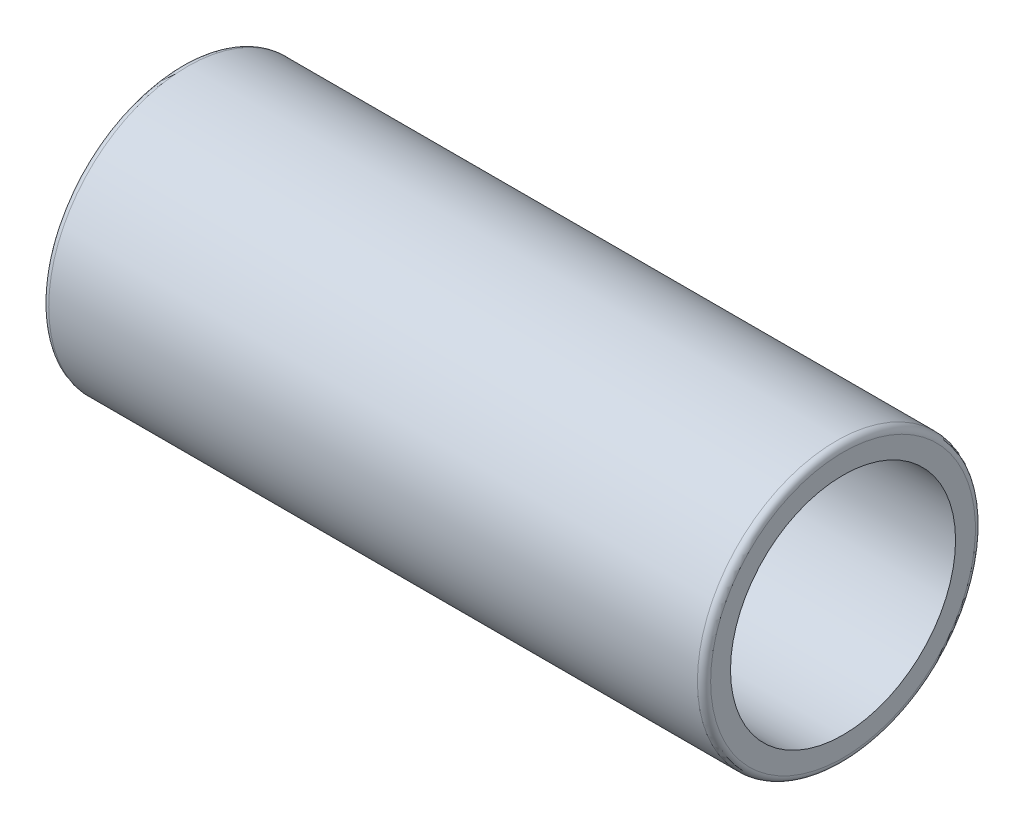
ISO-10303-21;
HEADER;
FILE_DESCRIPTION(('STEP AP214'),'2;1');
FILE_NAME('part.step','',(''),(''),'','','');
FILE_SCHEMA(('AUTOMOTIVE_DESIGN { 1 0 10303 214 1 1 1 1 }'));
ENDSEC;
DATA;
#1=APPLICATION_CONTEXT('core data for automotive mechanical design processes');
#2=APPLICATION_PROTOCOL_DEFINITION('international standard','automotive_design',2000,#1);
#3=PRODUCT_CONTEXT('',#1,'mechanical');
#4=PRODUCT('Part','Part','',(#3));
#5=PRODUCT_RELATED_PRODUCT_CATEGORY('part','',(#4));
#6=PRODUCT_DEFINITION_FORMATION('','',#4);
#7=PRODUCT_DEFINITION_CONTEXT('part definition',#1,'design');
#8=PRODUCT_DEFINITION('design','',#6,#7);
#9=PRODUCT_DEFINITION_SHAPE('','',#8);
#10=(LENGTH_UNIT() NAMED_UNIT(*) SI_UNIT(.MILLI.,.METRE.));
#11=(NAMED_UNIT(*) PLANE_ANGLE_UNIT() SI_UNIT($,.RADIAN.));
#12=(NAMED_UNIT(*) SI_UNIT($,.STERADIAN.) SOLID_ANGLE_UNIT());
#13=UNCERTAINTY_MEASURE_WITH_UNIT(LENGTH_MEASURE(1.E-05),#10,'distance_accuracy_value','');
#14=(GEOMETRIC_REPRESENTATION_CONTEXT(3) GLOBAL_UNCERTAINTY_ASSIGNED_CONTEXT((#13)) GLOBAL_UNIT_ASSIGNED_CONTEXT((#10,
#11,#12)) REPRESENTATION_CONTEXT('',''));
#15=CARTESIAN_POINT('',(0.,0.,0.));
#16=DIRECTION('',(0.,0.,1.));
#17=DIRECTION('',(1.,0.,0.));
#18=AXIS2_PLACEMENT_3D('',#15,#16,#17);
#19=CARTESIAN_POINT('',(0.,0.,0.));
#20=DIRECTION('',(-1.,0.,0.));
#21=DIRECTION('',(0.,0.,1.));
#22=AXIS2_PLACEMENT_3D('',#19,#20,#21);
#23=CYLINDRICAL_SURFACE('',#22,6.);
#24=CARTESIAN_POINT('',(1.9999999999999,0.,0.));
#25=DIRECTION('',(-1.,0.,0.));
#26=DIRECTION('',(0.,0.,1.));
#27=AXIS2_PLACEMENT_3D('',#24,#25,#26);
#28=CIRCLE('',#27,6.);
#29=CARTESIAN_POINT('',(1.9999999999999,0.,6.));
#30=VERTEX_POINT('',#29);
#31=EDGE_CURVE('E43',#30,#30,#28,.T.);
#32=ORIENTED_EDGE('',*,*,#31,.F.);
#33=EDGE_LOOP('',(#32));
#34=FACE_BOUND('',#33,.T.);
#35=CARTESIAN_POINT('',(0.,0.,0.));
#36=DIRECTION('',(-1.,0.,0.));
#37=DIRECTION('',(0.,0.,1.));
#38=AXIS2_PLACEMENT_3D('',#35,#36,#37);
#39=CIRCLE('',#38,6.);
#40=CARTESIAN_POINT('',(0.,0.,6.));
#41=VERTEX_POINT('',#40);
#42=EDGE_CURVE('E34',#41,#41,#39,.T.);
#43=ORIENTED_EDGE('',*,*,#42,.T.);
#44=EDGE_LOOP('',(#43));
#45=FACE_BOUND('',#44,.T.);
#46=ADVANCED_FACE('F14',(#34,#45),#23,.F.);
#47=CARTESIAN_POINT('',(0.,6.,0.));
#48=DIRECTION('',(1.,0.,0.));
#49=DIRECTION('',(0.,0.,-1.));
#50=AXIS2_PLACEMENT_3D('',#47,#48,#49);
#51=PLANE('',#50);
#52=CARTESIAN_POINT('',(0.,0.,0.));
#53=DIRECTION('',(1.,0.,0.));
#54=DIRECTION('',(0.,0.,-1.));
#55=AXIS2_PLACEMENT_3D('',#52,#53,#54);
#56=CIRCLE('',#55,20.);
#57=CARTESIAN_POINT('',(0.,0.,-20.));
#58=VERTEX_POINT('',#57);
#59=EDGE_CURVE('E21',#58,#58,#56,.F.);
#60=ORIENTED_EDGE('',*,*,#59,.T.);
#61=EDGE_LOOP('',(#60));
#62=FACE_BOUND('',#61,.T.);
#63=ORIENTED_EDGE('',*,*,#42,.F.);
#64=EDGE_LOOP('',(#63));
#65=FACE_BOUND('',#64,.T.);
#66=ADVANCED_FACE('F51',(#62,#65),#51,.F.);
#67=CARTESIAN_POINT('',(0.,0.,0.));
#68=DIRECTION('',(-1.,0.,0.));
#69=DIRECTION('',(0.,0.,1.));
#70=AXIS2_PLACEMENT_3D('',#67,#68,#69);
#71=CYLINDRICAL_SURFACE('',#70,21.);
#72=CARTESIAN_POINT('',(1.,0.,0.));
#73=DIRECTION('',(1.,0.,0.));
#74=DIRECTION('',(0.,0.,-1.));
#75=AXIS2_PLACEMENT_3D('',#72,#73,#74);
#76=CIRCLE('',#75,21.);
#77=CARTESIAN_POINT('',(1.,0.,-21.));
#78=VERTEX_POINT('',#77);
#79=EDGE_CURVE('E9',#78,#78,#76,.T.);
#80=ORIENTED_EDGE('',*,*,#79,.T.);
#81=EDGE_LOOP('',(#80));
#82=FACE_BOUND('',#81,.T.);
#83=CARTESIAN_POINT('',(99.,0.,0.));
#84=DIRECTION('',(-1.,0.,0.));
#85=DIRECTION('',(0.,0.,1.));
#86=AXIS2_PLACEMENT_3D('',#83,#84,#85);
#87=CIRCLE('',#86,21.);
#88=CARTESIAN_POINT('',(99.,0.,21.));
#89=VERTEX_POINT('',#88);
#90=EDGE_CURVE('E29',#89,#89,#87,.T.);
#91=ORIENTED_EDGE('',*,*,#90,.T.);
#92=EDGE_LOOP('',(#91));
#93=FACE_BOUND('',#92,.T.);
#94=ADVANCED_FACE('F56',(#82,#93),#71,.T.);
#95=CARTESIAN_POINT('',(100.,21.,0.));
#96=DIRECTION('',(-1.,0.,0.));
#97=DIRECTION('',(0.,0.,1.));
#98=AXIS2_PLACEMENT_3D('',#95,#96,#97);
#99=PLANE('',#98);
#100=CARTESIAN_POINT('',(100.,0.,0.));
#101=DIRECTION('',(-1.,0.,0.));
#102=DIRECTION('',(0.,0.,1.));
#103=AXIS2_PLACEMENT_3D('',#100,#101,#102);
#104=CIRCLE('',#103,20.);
#105=CARTESIAN_POINT('',(100.,0.,20.));
#106=VERTEX_POINT('',#105);
#107=EDGE_CURVE('E25',#106,#106,#104,.F.);
#108=ORIENTED_EDGE('',*,*,#107,.T.);
#109=EDGE_LOOP('',(#108));
#110=FACE_BOUND('',#109,.T.);
#111=CARTESIAN_POINT('',(100.,0.,0.));
#112=DIRECTION('',(-1.,0.,0.));
#113=DIRECTION('',(0.,0.,1.));
#114=AXIS2_PLACEMENT_3D('',#111,#112,#113);
#115=CIRCLE('',#114,17.);
#116=CARTESIAN_POINT('',(100.,0.,17.));
#117=VERTEX_POINT('',#116);
#118=EDGE_CURVE('E37',#117,#117,#115,.T.);
#119=ORIENTED_EDGE('',*,*,#118,.T.);
#120=EDGE_LOOP('',(#119));
#121=FACE_BOUND('',#120,.T.);
#122=ADVANCED_FACE('F63',(#110,#121),#99,.F.);
#123=CARTESIAN_POINT('',(0.,0.,0.));
#124=DIRECTION('',(-1.,0.,0.));
#125=DIRECTION('',(0.,0.,1.));
#126=AXIS2_PLACEMENT_3D('',#123,#124,#125);
#127=CYLINDRICAL_SURFACE('',#126,17.);
#128=ORIENTED_EDGE('',*,*,#118,.F.);
#129=EDGE_LOOP('',(#128));
#130=FACE_BOUND('',#129,.T.);
#131=CARTESIAN_POINT('',(13.,0.,0.));
#132=DIRECTION('',(-1.,0.,0.));
#133=DIRECTION('',(0.,0.,1.));
#134=AXIS2_PLACEMENT_3D('',#131,#132,#133);
#135=CIRCLE('',#134,17.);
#136=CARTESIAN_POINT('',(13.,0.,17.));
#137=VERTEX_POINT('',#136);
#138=EDGE_CURVE('E40',#137,#137,#135,.T.);
#139=ORIENTED_EDGE('',*,*,#138,.T.);
#140=EDGE_LOOP('',(#139));
#141=FACE_BOUND('',#140,.T.);
#142=ADVANCED_FACE('F75',(#130,#141),#127,.F.);
#143=CARTESIAN_POINT('',(1.9999999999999,0.,0.));
#144=DIRECTION('',(1.,0.,0.));
#145=DIRECTION('',(0.,0.,-1.));
#146=AXIS2_PLACEMENT_3D('',#143,#144,#145);
#147=CONICAL_SURFACE('',#146,6.,0.785398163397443);
#148=ORIENTED_EDGE('',*,*,#138,.F.);
#149=EDGE_LOOP('',(#148));
#150=FACE_BOUND('',#149,.T.);
#151=ORIENTED_EDGE('',*,*,#31,.T.);
#152=EDGE_LOOP('',(#151));
#153=FACE_BOUND('',#152,.T.);
#154=ADVANCED_FACE('F47',(#150,#153),#147,.F.);
#155=CARTESIAN_POINT('',(99.,0.,0.));
#156=DIRECTION('',(-1.,0.,0.));
#157=DIRECTION('',(0.,0.,1.));
#158=AXIS2_PLACEMENT_3D('',#155,#156,#157);
#159=TOROIDAL_SURFACE('',#158,20.,1.);
#160=ORIENTED_EDGE('',*,*,#107,.F.);
#161=EDGE_LOOP('',(#160));
#162=FACE_BOUND('',#161,.T.);
#163=ORIENTED_EDGE('',*,*,#90,.F.);
#164=EDGE_LOOP('',(#163));
#165=FACE_BOUND('',#164,.T.);
#166=ADVANCED_FACE('F66',(#162,#165),#159,.T.);
#167=CARTESIAN_POINT('',(1.,0.,0.));
#168=DIRECTION('',(1.,0.,0.));
#169=DIRECTION('',(0.,0.,-1.));
#170=AXIS2_PLACEMENT_3D('',#167,#168,#169);
#171=TOROIDAL_SURFACE('',#170,20.,1.);
#172=ORIENTED_EDGE('',*,*,#79,.F.);
#173=EDGE_LOOP('',(#172));
#174=FACE_BOUND('',#173,.T.);
#175=ORIENTED_EDGE('',*,*,#59,.F.);
#176=EDGE_LOOP('',(#175));
#177=FACE_BOUND('',#176,.T.);
#178=ADVANCED_FACE('F16',(#174,#177),#171,.T.);
#179=CLOSED_SHELL('',(#46,#66,#94,#122,#142,#154,#166,#178));
#180=MANIFOLD_SOLID_BREP('B1',#179);
#181=ADVANCED_BREP_SHAPE_REPRESENTATION('',(#18,#180),#14);
#182=SHAPE_DEFINITION_REPRESENTATION(#9,#181);
ENDSEC;
END-ISO-10303-21;
